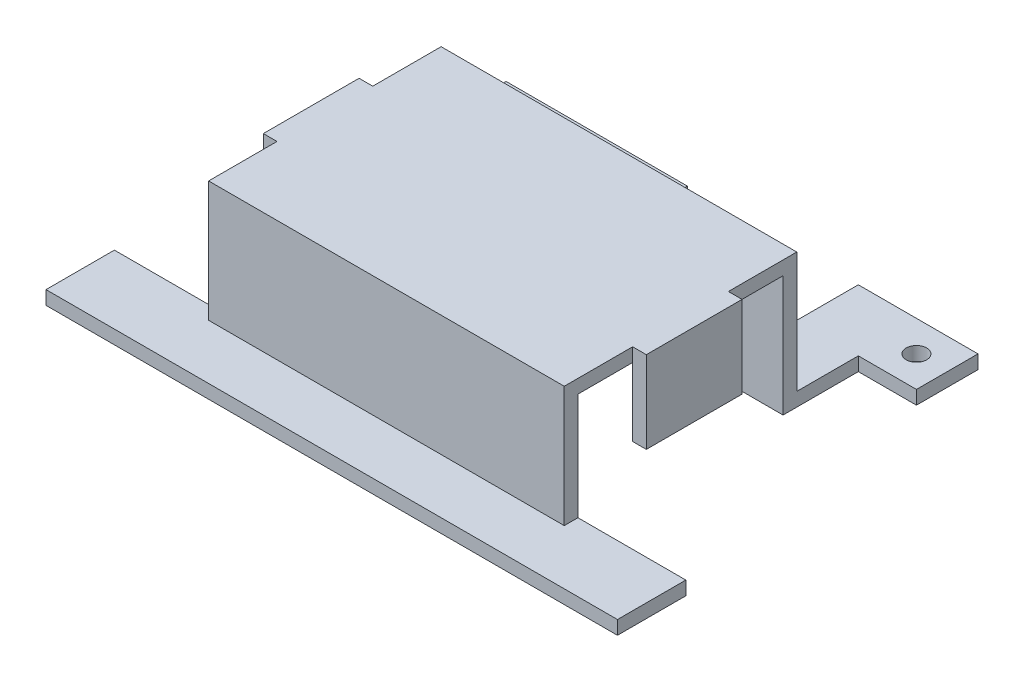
ISO-10303-21;
HEADER;
FILE_DESCRIPTION(('STEP AP214'),'2;1');
FILE_NAME('part.step','',(''),(''),'','','');
FILE_SCHEMA(('AUTOMOTIVE_DESIGN { 1 0 10303 214 1 1 1 1 }'));
ENDSEC;
DATA;
#1=APPLICATION_CONTEXT('core data for automotive mechanical design processes');
#2=APPLICATION_PROTOCOL_DEFINITION('international standard','automotive_design',2000,#1);
#3=PRODUCT_CONTEXT('',#1,'mechanical');
#4=PRODUCT('Part','Part','',(#3));
#5=PRODUCT_RELATED_PRODUCT_CATEGORY('part','',(#4));
#6=PRODUCT_DEFINITION_FORMATION('','',#4);
#7=PRODUCT_DEFINITION_CONTEXT('part definition',#1,'design');
#8=PRODUCT_DEFINITION('design','',#6,#7);
#9=PRODUCT_DEFINITION_SHAPE('','',#8);
#10=(LENGTH_UNIT() NAMED_UNIT(*) SI_UNIT(.MILLI.,.METRE.));
#11=(NAMED_UNIT(*) PLANE_ANGLE_UNIT() SI_UNIT($,.RADIAN.));
#12=(NAMED_UNIT(*) SI_UNIT($,.STERADIAN.) SOLID_ANGLE_UNIT());
#13=UNCERTAINTY_MEASURE_WITH_UNIT(LENGTH_MEASURE(1.E-05),#10,'distance_accuracy_value','');
#14=(GEOMETRIC_REPRESENTATION_CONTEXT(3) GLOBAL_UNCERTAINTY_ASSIGNED_CONTEXT((#13)) GLOBAL_UNIT_ASSIGNED_CONTEXT((#10,
#11,#12)) REPRESENTATION_CONTEXT('',''));
#15=CARTESIAN_POINT('',(0.,0.,0.));
#16=DIRECTION('',(0.,0.,1.));
#17=DIRECTION('',(1.,0.,0.));
#18=AXIS2_PLACEMENT_3D('',#15,#16,#17);
#19=CARTESIAN_POINT('',(0.,17.65,0.));
#20=DIRECTION('',(0.,1.,0.));
#21=DIRECTION('',(0.,0.,1.));
#22=AXIS2_PLACEMENT_3D('',#19,#20,#21);
#23=PLANE('',#22);
#24=DIRECTION('',(0.,0.,-1.));
#25=VECTOR('',#24,1.);
#26=CARTESIAN_POINT('',(52.,17.65,-24.));
#27=LINE('',#26,#25);
#28=CARTESIAN_POINT('',(52.,17.65,-10.));
#29=VERTEX_POINT('',#28);
#30=CARTESIAN_POINT('',(52.,17.65,-24.));
#31=VERTEX_POINT('',#30);
#32=EDGE_CURVE('E279',#29,#31,#27,.T.);
#33=ORIENTED_EDGE('',*,*,#32,.F.);
#34=DIRECTION('',(0.,0.,1.));
#35=VECTOR('',#34,1.);
#36=CARTESIAN_POINT('',(52.,17.65,-2.));
#37=LINE('',#36,#35);
#38=CARTESIAN_POINT('',(52.,17.65,-2.));
#39=VERTEX_POINT('',#38);
#40=EDGE_CURVE('E547',#29,#39,#37,.T.);
#41=ORIENTED_EDGE('',*,*,#40,.T.);
#42=DIRECTION('',(-1.,0.,0.));
#43=VECTOR('',#42,1.);
#44=CARTESIAN_POINT('',(52.,17.65,-2.));
#45=LINE('',#44,#43);
#46=CARTESIAN_POINT('',(0.,17.65,-2.));
#47=VERTEX_POINT('',#46);
#48=EDGE_CURVE('E546',#39,#47,#45,.T.);
#49=ORIENTED_EDGE('',*,*,#48,.T.);
#50=DIRECTION('',(0.,0.,-1.));
#51=VECTOR('',#50,1.);
#52=CARTESIAN_POINT('',(0.,17.65,-2.));
#53=LINE('',#52,#51);
#54=CARTESIAN_POINT('',(0.,17.65,-10.));
#55=VERTEX_POINT('',#54);
#56=EDGE_CURVE('E552',#47,#55,#53,.T.);
#57=ORIENTED_EDGE('',*,*,#56,.T.);
#58=DIRECTION('',(0.,0.,1.));
#59=VECTOR('',#58,1.);
#60=CARTESIAN_POINT('',(0.,17.65,-24.));
#61=LINE('',#60,#59);
#62=CARTESIAN_POINT('',(0.,17.65,-24.));
#63=VERTEX_POINT('',#62);
#64=EDGE_CURVE('E285',#63,#55,#61,.T.);
#65=ORIENTED_EDGE('',*,*,#64,.F.);
#66=CARTESIAN_POINT('',(0.,17.65,-34.));
#67=VERTEX_POINT('',#66);
#68=EDGE_CURVE('E551',#63,#67,#53,.T.);
#69=ORIENTED_EDGE('',*,*,#68,.T.);
#70=DIRECTION('',(-1.,0.,0.));
#71=VECTOR('',#70,1.);
#72=CARTESIAN_POINT('',(0.,17.65,-34.));
#73=LINE('',#72,#71);
#74=CARTESIAN_POINT('',(9.5,17.65,-34.));
#75=VERTEX_POINT('',#74);
#76=EDGE_CURVE('E398',#75,#67,#73,.T.);
#77=ORIENTED_EDGE('',*,*,#76,.F.);
#78=DIRECTION('',(0.,0.,-1.));
#79=VECTOR('',#78,1.);
#80=CARTESIAN_POINT('',(9.5,17.65,-43.));
#81=LINE('',#80,#79);
#82=CARTESIAN_POINT('',(9.5,17.65,-32.));
#83=VERTEX_POINT('',#82);
#84=EDGE_CURVE('E385',#83,#75,#81,.T.);
#85=ORIENTED_EDGE('',*,*,#84,.F.);
#86=DIRECTION('',(1.,0.,0.));
#87=VECTOR('',#86,1.);
#88=CARTESIAN_POINT('',(52.,17.65,-32.));
#89=LINE('',#88,#87);
#90=CARTESIAN_POINT('',(52.,17.65,-32.));
#91=VERTEX_POINT('',#90);
#92=EDGE_CURVE('E556',#83,#91,#89,.T.);
#93=ORIENTED_EDGE('',*,*,#92,.T.);
#94=EDGE_CURVE('E542',#91,#31,#37,.T.);
#95=ORIENTED_EDGE('',*,*,#94,.T.);
#96=EDGE_LOOP('',(#33,#41,#49,#57,#65,#69,#77,#85,#93,#95));
#97=FACE_BOUND('',#96,.T.);
#98=ADVANCED_FACE('F39',(#97),#23,.F.);
#99=CARTESIAN_POINT('',(52.,19.65,0.));
#100=DIRECTION('',(-1.,0.,0.));
#101=DIRECTION('',(0.,0.,1.));
#102=AXIS2_PLACEMENT_3D('',#99,#100,#101);
#103=PLANE('',#102);
#104=DIRECTION('',(0.,1.,0.));
#105=VECTOR('',#104,1.);
#106=CARTESIAN_POINT('',(52.,17.65,-24.));
#107=LINE('',#106,#105);
#108=CARTESIAN_POINT('',(52.,19.65,-24.));
#109=VERTEX_POINT('',#108);
#110=EDGE_CURVE('E316',#31,#109,#107,.T.);
#111=ORIENTED_EDGE('',*,*,#110,.F.);
#112=ORIENTED_EDGE('',*,*,#94,.F.);
#113=DIRECTION('',(0.,-1.,0.));
#114=VECTOR('',#113,1.);
#115=CARTESIAN_POINT('',(52.,17.65,-32.));
#116=LINE('',#115,#114);
#117=CARTESIAN_POINT('',(52.,0.,-32.));
#118=VERTEX_POINT('',#117);
#119=EDGE_CURVE('E565',#91,#118,#116,.T.);
#120=ORIENTED_EDGE('',*,*,#119,.T.);
#121=DIRECTION('',(0.,0.,-1.));
#122=VECTOR('',#121,1.);
#123=CARTESIAN_POINT('',(52.,0.,0.));
#124=LINE('',#123,#122);
#125=CARTESIAN_POINT('',(52.,0.,-43.));
#126=VERTEX_POINT('',#125);
#127=EDGE_CURVE('E569',#118,#126,#124,.T.);
#128=ORIENTED_EDGE('',*,*,#127,.T.);
#129=DIRECTION('',(0.,1.,0.));
#130=VECTOR('',#129,1.);
#131=CARTESIAN_POINT('',(52.,2.,-43.));
#132=LINE('',#131,#130);
#133=CARTESIAN_POINT('',(52.,2.,-43.));
#134=VERTEX_POINT('',#133);
#135=EDGE_CURVE('E361',#126,#134,#132,.T.);
#136=ORIENTED_EDGE('',*,*,#135,.T.);
#137=DIRECTION('',(0.,0.,1.));
#138=VECTOR('',#137,1.);
#139=CARTESIAN_POINT('',(52.,2.,-43.));
#140=LINE('',#139,#138);
#141=CARTESIAN_POINT('',(52.,2.,-34.));
#142=VERTEX_POINT('',#141);
#143=EDGE_CURVE('E365',#134,#142,#140,.T.);
#144=ORIENTED_EDGE('',*,*,#143,.T.);
#145=DIRECTION('',(0.,-1.,0.));
#146=VECTOR('',#145,1.);
#147=CARTESIAN_POINT('',(52.,19.65,-34.));
#148=LINE('',#147,#146);
#149=CARTESIAN_POINT('',(52.,19.65,-34.));
#150=VERTEX_POINT('',#149);
#151=EDGE_CURVE('E603',#150,#142,#148,.T.);
#152=ORIENTED_EDGE('',*,*,#151,.F.);
#153=DIRECTION('',(0.,0.,-1.));
#154=VECTOR('',#153,1.);
#155=CARTESIAN_POINT('',(52.,19.65,0.));
#156=LINE('',#155,#154);
#157=EDGE_CURVE('E585',#109,#150,#156,.T.);
#158=ORIENTED_EDGE('',*,*,#157,.F.);
#159=EDGE_LOOP('',(#111,#112,#120,#128,#136,#144,#152,#158));
#160=FACE_BOUND('',#159,.T.);
#161=ADVANCED_FACE('F669',(#160),#103,.F.);
#162=DIRECTION('',(0.,-1.,0.));
#163=VECTOR('',#162,1.);
#164=CARTESIAN_POINT('',(52.,17.65,-10.));
#165=LINE('',#164,#163);
#166=CARTESIAN_POINT('',(52.,19.65,-10.));
#167=VERTEX_POINT('',#166);
#168=EDGE_CURVE('E320',#167,#29,#165,.T.);
#169=ORIENTED_EDGE('',*,*,#168,.F.);
#170=CARTESIAN_POINT('',(52.,19.65,0.));
#171=VERTEX_POINT('',#170);
#172=EDGE_CURVE('E586',#171,#167,#156,.T.);
#173=ORIENTED_EDGE('',*,*,#172,.F.);
#174=DIRECTION('',(0.,-1.,0.));
#175=VECTOR('',#174,1.);
#176=CARTESIAN_POINT('',(52.,19.65,0.));
#177=LINE('',#176,#175);
#178=CARTESIAN_POINT('',(52.,2.,0.));
#179=VERTEX_POINT('',#178);
#180=EDGE_CURVE('E607',#171,#179,#177,.T.);
#181=ORIENTED_EDGE('',*,*,#180,.T.);
#182=DIRECTION('',(0.,0.,1.));
#183=VECTOR('',#182,1.);
#184=CARTESIAN_POINT('',(52.,2.,8.));
#185=LINE('',#184,#183);
#186=CARTESIAN_POINT('',(52.,2.,-2.));
#187=VERTEX_POINT('',#186);
#188=EDGE_CURVE('E402',#187,#179,#185,.T.);
#189=ORIENTED_EDGE('',*,*,#188,.F.);
#190=DIRECTION('',(0.,-1.,0.));
#191=VECTOR('',#190,1.);
#192=CARTESIAN_POINT('',(52.,17.65,-2.));
#193=LINE('',#192,#191);
#194=EDGE_CURVE('E559',#39,#187,#193,.T.);
#195=ORIENTED_EDGE('',*,*,#194,.F.);
#196=ORIENTED_EDGE('',*,*,#40,.F.);
#197=EDGE_LOOP('',(#169,#173,#181,#189,#195,#196));
#198=FACE_BOUND('',#197,.T.);
#199=ADVANCED_FACE('F692',(#198),#103,.F.);
#200=CARTESIAN_POINT('',(0.,19.65,0.));
#201=DIRECTION('',(1.,0.,0.));
#202=DIRECTION('',(0.,0.,-1.));
#203=AXIS2_PLACEMENT_3D('',#200,#201,#202);
#204=PLANE('',#203);
#205=DIRECTION('',(0.,-1.,0.));
#206=VECTOR('',#205,1.);
#207=CARTESIAN_POINT('',(0.,19.65,-24.));
#208=LINE('',#207,#206);
#209=CARTESIAN_POINT('',(0.,19.65,-24.));
#210=VERTEX_POINT('',#209);
#211=EDGE_CURVE('E337',#210,#63,#208,.T.);
#212=ORIENTED_EDGE('',*,*,#211,.F.);
#213=DIRECTION('',(0.,0.,1.));
#214=VECTOR('',#213,1.);
#215=CARTESIAN_POINT('',(0.,19.65,0.));
#216=LINE('',#215,#214);
#217=CARTESIAN_POINT('',(0.,19.65,-34.));
#218=VERTEX_POINT('',#217);
#219=EDGE_CURVE('E577',#218,#210,#216,.T.);
#220=ORIENTED_EDGE('',*,*,#219,.F.);
#221=DIRECTION('',(0.,-1.,0.));
#222=VECTOR('',#221,1.);
#223=CARTESIAN_POINT('',(0.,19.65,-34.));
#224=LINE('',#223,#222);
#225=EDGE_CURVE('E593',#218,#67,#224,.T.);
#226=ORIENTED_EDGE('',*,*,#225,.T.);
#227=ORIENTED_EDGE('',*,*,#68,.F.);
#228=EDGE_LOOP('',(#212,#220,#226,#227));
#229=FACE_BOUND('',#228,.T.);
#230=ADVANCED_FACE('F41',(#229),#204,.F.);
#231=DIRECTION('',(0.,1.,0.));
#232=VECTOR('',#231,1.);
#233=CARTESIAN_POINT('',(0.,19.65,-10.));
#234=LINE('',#233,#232);
#235=CARTESIAN_POINT('',(0.,19.65,-10.));
#236=VERTEX_POINT('',#235);
#237=EDGE_CURVE('E342',#55,#236,#234,.T.);
#238=ORIENTED_EDGE('',*,*,#237,.F.);
#239=ORIENTED_EDGE('',*,*,#56,.F.);
#240=DIRECTION('',(0.,-1.,0.));
#241=VECTOR('',#240,1.);
#242=CARTESIAN_POINT('',(0.,17.65,-2.));
#243=LINE('',#242,#241);
#244=CARTESIAN_POINT('',(0.,2.,-2.));
#245=VERTEX_POINT('',#244);
#246=EDGE_CURVE('E570',#47,#245,#243,.T.);
#247=ORIENTED_EDGE('',*,*,#246,.T.);
#248=DIRECTION('',(0.,0.,-1.));
#249=VECTOR('',#248,1.);
#250=CARTESIAN_POINT('',(0.,2.,8.));
#251=LINE('',#250,#249);
#252=CARTESIAN_POINT('',(0.,2.,0.));
#253=VERTEX_POINT('',#252);
#254=EDGE_CURVE('E423',#253,#245,#251,.T.);
#255=ORIENTED_EDGE('',*,*,#254,.F.);
#256=DIRECTION('',(0.,-1.,0.));
#257=VECTOR('',#256,1.);
#258=CARTESIAN_POINT('',(0.,19.65,0.));
#259=LINE('',#258,#257);
#260=CARTESIAN_POINT('',(0.,19.65,0.));
#261=VERTEX_POINT('',#260);
#262=EDGE_CURVE('E611',#261,#253,#259,.T.);
#263=ORIENTED_EDGE('',*,*,#262,.F.);
#264=EDGE_CURVE('E582',#236,#261,#216,.T.);
#265=ORIENTED_EDGE('',*,*,#264,.F.);
#266=EDGE_LOOP('',(#238,#239,#247,#255,#263,#265));
#267=FACE_BOUND('',#266,.T.);
#268=ADVANCED_FACE('F706',(#267),#204,.F.);
#269=CARTESIAN_POINT('',(52.,17.65,-32.));
#270=DIRECTION('',(0.,0.,-1.));
#271=DIRECTION('',(-1.,0.,0.));
#272=AXIS2_PLACEMENT_3D('',#269,#270,#271);
#273=PLANE('',#272);
#274=DIRECTION('',(0.,1.,0.));
#275=VECTOR('',#274,1.);
#276=CARTESIAN_POINT('',(9.5,17.65,-32.));
#277=LINE('',#276,#275);
#278=CARTESIAN_POINT('',(9.5,0.,-32.));
#279=VERTEX_POINT('',#278);
#280=EDGE_CURVE('E382',#279,#83,#277,.T.);
#281=ORIENTED_EDGE('',*,*,#280,.F.);
#282=DIRECTION('',(1.,0.,0.));
#283=VECTOR('',#282,1.);
#284=CARTESIAN_POINT('',(52.,0.,-32.));
#285=LINE('',#284,#283);
#286=EDGE_CURVE('E562',#279,#118,#285,.T.);
#287=ORIENTED_EDGE('',*,*,#286,.T.);
#288=ORIENTED_EDGE('',*,*,#119,.F.);
#289=ORIENTED_EDGE('',*,*,#92,.F.);
#290=EDGE_LOOP('',(#281,#287,#288,#289));
#291=FACE_BOUND('',#290,.T.);
#292=ADVANCED_FACE('F743',(#291),#273,.F.);
#293=CARTESIAN_POINT('',(0.,19.65,0.));
#294=DIRECTION('',(0.,0.,-1.));
#295=DIRECTION('',(-1.,0.,0.));
#296=AXIS2_PLACEMENT_3D('',#293,#294,#295);
#297=PLANE('',#296);
#298=DIRECTION('',(-1.,0.,0.));
#299=VECTOR('',#298,1.);
#300=CARTESIAN_POINT('',(0.,2.,0.));
#301=LINE('',#300,#299);
#302=EDGE_CURVE('E445',#179,#253,#301,.T.);
#303=ORIENTED_EDGE('',*,*,#302,.F.);
#304=ORIENTED_EDGE('',*,*,#180,.F.);
#305=DIRECTION('',(1.,0.,0.));
#306=VECTOR('',#305,1.);
#307=CARTESIAN_POINT('',(0.,19.65,0.));
#308=LINE('',#307,#306);
#309=EDGE_CURVE('E581',#261,#171,#308,.T.);
#310=ORIENTED_EDGE('',*,*,#309,.F.);
#311=ORIENTED_EDGE('',*,*,#262,.T.);
#312=EDGE_LOOP('',(#303,#304,#310,#311));
#313=FACE_BOUND('',#312,.T.);
#314=ADVANCED_FACE('F700',(#313),#297,.F.);
#315=CARTESIAN_POINT('',(0.,19.65,-34.));
#316=DIRECTION('',(0.,0.,1.));
#317=DIRECTION('',(1.,0.,0.));
#318=AXIS2_PLACEMENT_3D('',#315,#316,#317);
#319=PLANE('',#318);
#320=DIRECTION('',(0.,-1.,0.));
#321=VECTOR('',#320,1.);
#322=CARTESIAN_POINT('',(9.5,19.65,-34.));
#323=LINE('',#322,#321);
#324=CARTESIAN_POINT('',(9.5,2.,-34.));
#325=VERTEX_POINT('',#324);
#326=EDGE_CURVE('E395',#75,#325,#323,.T.);
#327=ORIENTED_EDGE('',*,*,#326,.F.);
#328=ORIENTED_EDGE('',*,*,#76,.T.);
#329=ORIENTED_EDGE('',*,*,#225,.F.);
#330=DIRECTION('',(-1.,0.,0.));
#331=VECTOR('',#330,1.);
#332=CARTESIAN_POINT('',(0.,19.65,-34.));
#333=LINE('',#332,#331);
#334=EDGE_CURVE('E590',#150,#218,#333,.T.);
#335=ORIENTED_EDGE('',*,*,#334,.F.);
#336=ORIENTED_EDGE('',*,*,#151,.T.);
#337=DIRECTION('',(1.,0.,0.));
#338=VECTOR('',#337,1.);
#339=CARTESIAN_POINT('',(52.,2.,-34.));
#340=LINE('',#339,#338);
#341=CARTESIAN_POINT('',(43.,2.,-34.));
#342=VERTEX_POINT('',#341);
#343=EDGE_CURVE('E521',#342,#142,#340,.T.);
#344=ORIENTED_EDGE('',*,*,#343,.F.);
#345=DIRECTION('',(0.,1.,0.));
#346=VECTOR('',#345,1.);
#347=CARTESIAN_POINT('',(43.,0.,-34.));
#348=LINE('',#347,#346);
#349=CARTESIAN_POINT('',(43.,0.,-34.));
#350=VERTEX_POINT('',#349);
#351=EDGE_CURVE('E516',#350,#342,#348,.T.);
#352=ORIENTED_EDGE('',*,*,#351,.F.);
#353=DIRECTION('',(-1.,0.,0.));
#354=VECTOR('',#353,1.);
#355=CARTESIAN_POINT('',(0.,0.,-34.));
#356=LINE('',#355,#354);
#357=CARTESIAN_POINT('',(18.,0.,-34.));
#358=VERTEX_POINT('',#357);
#359=EDGE_CURVE('E596',#350,#358,#356,.T.);
#360=ORIENTED_EDGE('',*,*,#359,.T.);
#361=DIRECTION('',(0.,-1.,0.));
#362=VECTOR('',#361,1.);
#363=CARTESIAN_POINT('',(18.,0.,-34.));
#364=LINE('',#363,#362);
#365=CARTESIAN_POINT('',(18.,2.,-34.));
#366=VERTEX_POINT('',#365);
#367=EDGE_CURVE('E498',#366,#358,#364,.T.);
#368=ORIENTED_EDGE('',*,*,#367,.F.);
#369=DIRECTION('',(1.,0.,0.));
#370=VECTOR('',#369,1.);
#371=CARTESIAN_POINT('',(0.,2.,-34.));
#372=LINE('',#371,#370);
#373=EDGE_CURVE('E493',#325,#366,#372,.T.);
#374=ORIENTED_EDGE('',*,*,#373,.F.);
#375=EDGE_LOOP('',(#327,#328,#329,#335,#336,#344,#352,#360,#368,#374));
#376=FACE_BOUND('',#375,.T.);
#377=ADVANCED_FACE('F643',(#376),#319,.F.);
#378=CARTESIAN_POINT('',(0.,0.,0.));
#379=DIRECTION('',(0.,-1.,0.));
#380=DIRECTION('',(0.,0.,-1.));
#381=AXIS2_PLACEMENT_3D('',#378,#379,#380);
#382=PLANE('',#381);
#383=DIRECTION('',(1.,0.,0.));
#384=VECTOR('',#383,1.);
#385=CARTESIAN_POINT('',(52.,0.,-43.));
#386=LINE('',#385,#384);
#387=CARTESIAN_POINT('',(60.5,0.,-43.));
#388=VERTEX_POINT('',#387);
#389=EDGE_CURVE('E55',#126,#388,#386,.T.);
#390=ORIENTED_EDGE('',*,*,#389,.F.);
#391=ORIENTED_EDGE('',*,*,#127,.F.);
#392=ORIENTED_EDGE('',*,*,#286,.F.);
#393=DIRECTION('',(0.,0.,1.));
#394=VECTOR('',#393,1.);
#395=CARTESIAN_POINT('',(9.5,0.,-43.));
#396=LINE('',#395,#394);
#397=CARTESIAN_POINT('',(9.5,0.,-43.));
#398=VERTEX_POINT('',#397);
#399=EDGE_CURVE('E379',#398,#279,#396,.T.);
#400=ORIENTED_EDGE('',*,*,#399,.F.);
#401=DIRECTION('',(-1.,0.,0.));
#402=VECTOR('',#401,1.);
#403=CARTESIAN_POINT('',(9.5,0.,-43.));
#404=LINE('',#403,#402);
#405=CARTESIAN_POINT('',(-8.5,0.,-43.));
#406=VERTEX_POINT('',#405);
#407=EDGE_CURVE('E389',#398,#406,#404,.T.);
#408=ORIENTED_EDGE('',*,*,#407,.T.);
#409=DIRECTION('',(0.,0.,1.));
#410=VECTOR('',#409,1.);
#411=CARTESIAN_POINT('',(-8.5,0.,-34.));
#412=LINE('',#411,#410);
#413=CARTESIAN_POINT('',(-8.5,0.,-52.));
#414=VERTEX_POINT('',#413);
#415=EDGE_CURVE('E478',#414,#406,#412,.T.);
#416=ORIENTED_EDGE('',*,*,#415,.F.);
#417=DIRECTION('',(-1.,0.,0.));
#418=VECTOR('',#417,1.);
#419=CARTESIAN_POINT('',(0.,0.,-52.));
#420=LINE('',#419,#418);
#421=CARTESIAN_POINT('',(18.,0.,-52.));
#422=VERTEX_POINT('',#421);
#423=EDGE_CURVE('E501',#422,#414,#420,.T.);
#424=ORIENTED_EDGE('',*,*,#423,.F.);
#425=DIRECTION('',(0.,0.,1.));
#426=VECTOR('',#425,1.);
#427=CARTESIAN_POINT('',(18.,0.,-52.));
#428=LINE('',#427,#426);
#429=EDGE_CURVE('E504',#422,#358,#428,.T.);
#430=ORIENTED_EDGE('',*,*,#429,.T.);
#431=ORIENTED_EDGE('',*,*,#359,.F.);
#432=DIRECTION('',(0.,0.,1.));
#433=VECTOR('',#432,1.);
#434=CARTESIAN_POINT('',(43.,0.,-52.));
#435=LINE('',#434,#433);
#436=CARTESIAN_POINT('',(43.,0.,-52.));
#437=VERTEX_POINT('',#436);
#438=EDGE_CURVE('E537',#437,#350,#435,.T.);
#439=ORIENTED_EDGE('',*,*,#438,.F.);
#440=DIRECTION('',(-1.,0.,0.));
#441=VECTOR('',#440,1.);
#442=CARTESIAN_POINT('',(52.,0.,-52.));
#443=LINE('',#442,#441);
#444=CARTESIAN_POINT('',(60.5,0.,-52.));
#445=VERTEX_POINT('',#444);
#446=EDGE_CURVE('E517',#445,#437,#443,.T.);
#447=ORIENTED_EDGE('',*,*,#446,.F.);
#448=DIRECTION('',(0.,0.,-1.));
#449=VECTOR('',#448,1.);
#450=CARTESIAN_POINT('',(60.5,0.,-34.));
#451=LINE('',#450,#449);
#452=EDGE_CURVE('E482',#388,#445,#451,.T.);
#453=ORIENTED_EDGE('',*,*,#452,.F.);
#454=EDGE_LOOP('',(#390,#391,#392,#400,#408,#416,#424,#430,#431,#439,#447,#453));
#455=FACE_BOUND('',#454,.T.);
#456=CARTESIAN_POINT('',(56.,0.,-47.5));
#457=DIRECTION('',(0.,1.,0.));
#458=DIRECTION('',(0.,0.,1.));
#459=AXIS2_PLACEMENT_3D('',#456,#457,#458);
#460=CIRCLE('',#459,1.5);
#461=CARTESIAN_POINT('',(56.,0.,-46.));
#462=VERTEX_POINT('',#461);
#463=EDGE_CURVE('E456',#462,#462,#460,.T.);
#464=ORIENTED_EDGE('',*,*,#463,.T.);
#465=EDGE_LOOP('',(#464));
#466=FACE_BOUND('',#465,.T.);
#467=CARTESIAN_POINT('',(-4.,0.,-47.5));
#468=DIRECTION('',(0.,1.,0.));
#469=DIRECTION('',(0.,0.,1.));
#470=AXIS2_PLACEMENT_3D('',#467,#468,#469);
#471=CIRCLE('',#470,1.5);
#472=CARTESIAN_POINT('',(-4.,0.,-46.));
#473=VERTEX_POINT('',#472);
#474=EDGE_CURVE('E465',#473,#473,#471,.T.);
#475=ORIENTED_EDGE('',*,*,#474,.T.);
#476=EDGE_LOOP('',(#475));
#477=FACE_BOUND('',#476,.T.);
#478=ADVANCED_FACE('F631',(#455,#466,#477),#382,.T.);
#479=CARTESIAN_POINT('',(0.,19.65,0.));
#480=DIRECTION('',(0.,-1.,0.));
#481=DIRECTION('',(0.,0.,-1.));
#482=AXIS2_PLACEMENT_3D('',#479,#480,#481);
#483=PLANE('',#482);
#484=ORIENTED_EDGE('',*,*,#219,.T.);
#485=DIRECTION('',(1.,0.,0.));
#486=VECTOR('',#485,1.);
#487=CARTESIAN_POINT('',(-2.,19.65,-24.));
#488=LINE('',#487,#486);
#489=CARTESIAN_POINT('',(-2.,19.65,-24.));
#490=VERTEX_POINT('',#489);
#491=EDGE_CURVE('E348',#490,#210,#488,.T.);
#492=ORIENTED_EDGE('',*,*,#491,.F.);
#493=DIRECTION('',(0.,0.,-1.));
#494=VECTOR('',#493,1.);
#495=CARTESIAN_POINT('',(-2.,19.65,-24.));
#496=LINE('',#495,#494);
#497=CARTESIAN_POINT('',(-2.,19.65,-10.));
#498=VERTEX_POINT('',#497);
#499=EDGE_CURVE('E345',#498,#490,#496,.T.);
#500=ORIENTED_EDGE('',*,*,#499,.F.);
#501=DIRECTION('',(1.,0.,0.));
#502=VECTOR('',#501,1.);
#503=CARTESIAN_POINT('',(-2.,19.65,-10.));
#504=LINE('',#503,#502);
#505=EDGE_CURVE('E356',#498,#236,#504,.T.);
#506=ORIENTED_EDGE('',*,*,#505,.T.);
#507=ORIENTED_EDGE('',*,*,#264,.T.);
#508=ORIENTED_EDGE('',*,*,#309,.T.);
#509=ORIENTED_EDGE('',*,*,#172,.T.);
#510=DIRECTION('',(-1.,0.,0.));
#511=VECTOR('',#510,1.);
#512=CARTESIAN_POINT('',(54.,19.65,-10.));
#513=LINE('',#512,#511);
#514=CARTESIAN_POINT('',(54.,19.65,-10.));
#515=VERTEX_POINT('',#514);
#516=EDGE_CURVE('E326',#515,#167,#513,.T.);
#517=ORIENTED_EDGE('',*,*,#516,.F.);
#518=DIRECTION('',(0.,0.,1.));
#519=VECTOR('',#518,1.);
#520=CARTESIAN_POINT('',(54.,19.65,-24.));
#521=LINE('',#520,#519);
#522=CARTESIAN_POINT('',(54.,19.65,-24.));
#523=VERTEX_POINT('',#522);
#524=EDGE_CURVE('E319',#523,#515,#521,.T.);
#525=ORIENTED_EDGE('',*,*,#524,.F.);
#526=DIRECTION('',(-1.,0.,0.));
#527=VECTOR('',#526,1.);
#528=CARTESIAN_POINT('',(54.,19.65,-24.));
#529=LINE('',#528,#527);
#530=EDGE_CURVE('E334',#523,#109,#529,.T.);
#531=ORIENTED_EDGE('',*,*,#530,.T.);
#532=ORIENTED_EDGE('',*,*,#157,.T.);
#533=ORIENTED_EDGE('',*,*,#334,.T.);
#534=EDGE_LOOP('',(#484,#492,#500,#506,#507,#508,#509,#517,#525,#531,#532,#533));
#535=FACE_BOUND('',#534,.T.);
#536=ADVANCED_FACE('F675',(#535),#483,.F.);
#537=DIRECTION('',(-1.,0.,0.));
#538=VECTOR('',#537,1.);
#539=CARTESIAN_POINT('',(52.,0.,-2.));
#540=LINE('',#539,#538);
#541=CARTESIAN_POINT('',(67.78,0.,-2.));
#542=VERTEX_POINT('',#541);
#543=CARTESIAN_POINT('',(-15.78,0.,-2.));
#544=VERTEX_POINT('',#543);
#545=EDGE_CURVE('E541',#542,#544,#540,.T.);
#546=ORIENTED_EDGE('',*,*,#545,.F.);
#547=DIRECTION('',(0.,0.,-1.));
#548=VECTOR('',#547,1.);
#549=CARTESIAN_POINT('',(67.78,0.,8.));
#550=LINE('',#549,#548);
#551=CARTESIAN_POINT('',(67.78,0.,8.));
#552=VERTEX_POINT('',#551);
#553=EDGE_CURVE('E407',#552,#542,#550,.T.);
#554=ORIENTED_EDGE('',*,*,#553,.F.);
#555=DIRECTION('',(1.,0.,0.));
#556=VECTOR('',#555,1.);
#557=CARTESIAN_POINT('',(0.,0.,8.));
#558=LINE('',#557,#556);
#559=CARTESIAN_POINT('',(-15.78,0.,8.));
#560=VERTEX_POINT('',#559);
#561=EDGE_CURVE('E446',#560,#552,#558,.T.);
#562=ORIENTED_EDGE('',*,*,#561,.F.);
#563=DIRECTION('',(0.,0.,1.));
#564=VECTOR('',#563,1.);
#565=CARTESIAN_POINT('',(-15.78,0.,8.));
#566=LINE('',#565,#564);
#567=EDGE_CURVE('E435',#544,#560,#566,.T.);
#568=ORIENTED_EDGE('',*,*,#567,.F.);
#569=EDGE_LOOP('',(#546,#554,#562,#568));
#570=FACE_BOUND('',#569,.T.);
#571=ADVANCED_FACE('F716',(#570),#382,.T.);
#572=CARTESIAN_POINT('',(52.,17.65,-2.));
#573=DIRECTION('',(0.,0.,1.));
#574=DIRECTION('',(1.,0.,0.));
#575=AXIS2_PLACEMENT_3D('',#572,#573,#574);
#576=PLANE('',#575);
#577=ORIENTED_EDGE('',*,*,#545,.T.);
#578=DIRECTION('',(0.,-1.,0.));
#579=VECTOR('',#578,1.);
#580=CARTESIAN_POINT('',(-15.78,2.,-2.));
#581=LINE('',#580,#579);
#582=CARTESIAN_POINT('',(-15.78,2.,-2.));
#583=VERTEX_POINT('',#582);
#584=EDGE_CURVE('E431',#583,#544,#581,.T.);
#585=ORIENTED_EDGE('',*,*,#584,.F.);
#586=DIRECTION('',(1.,0.,0.));
#587=VECTOR('',#586,1.);
#588=CARTESIAN_POINT('',(-15.78,2.,-2.));
#589=LINE('',#588,#587);
#590=EDGE_CURVE('E439',#583,#245,#589,.T.);
#591=ORIENTED_EDGE('',*,*,#590,.T.);
#592=ORIENTED_EDGE('',*,*,#246,.F.);
#593=ORIENTED_EDGE('',*,*,#48,.F.);
#594=ORIENTED_EDGE('',*,*,#194,.T.);
#595=DIRECTION('',(-1.,0.,0.));
#596=VECTOR('',#595,1.);
#597=CARTESIAN_POINT('',(67.78,2.,-2.));
#598=LINE('',#597,#596);
#599=CARTESIAN_POINT('',(67.78,2.,-2.));
#600=VERTEX_POINT('',#599);
#601=EDGE_CURVE('E418',#600,#187,#598,.T.);
#602=ORIENTED_EDGE('',*,*,#601,.F.);
#603=DIRECTION('',(0.,1.,0.));
#604=VECTOR('',#603,1.);
#605=CARTESIAN_POINT('',(67.78,2.,-2.));
#606=LINE('',#605,#604);
#607=EDGE_CURVE('E411',#542,#600,#606,.T.);
#608=ORIENTED_EDGE('',*,*,#607,.F.);
#609=EDGE_LOOP('',(#577,#585,#591,#592,#593,#594,#602,#608));
#610=FACE_BOUND('',#609,.T.);
#611=ADVANCED_FACE('F689',(#610),#576,.F.);
#612=CARTESIAN_POINT('',(43.,0.,-52.));
#613=DIRECTION('',(1.,0.,0.));
#614=DIRECTION('',(0.,0.,-1.));
#615=AXIS2_PLACEMENT_3D('',#612,#613,#614);
#616=PLANE('',#615);
#617=ORIENTED_EDGE('',*,*,#351,.T.);
#618=DIRECTION('',(0.,0.,1.));
#619=VECTOR('',#618,1.);
#620=CARTESIAN_POINT('',(43.,2.,-52.));
#621=LINE('',#620,#619);
#622=CARTESIAN_POINT('',(43.,2.,-52.));
#623=VERTEX_POINT('',#622);
#624=EDGE_CURVE('E527',#623,#342,#621,.T.);
#625=ORIENTED_EDGE('',*,*,#624,.F.);
#626=DIRECTION('',(0.,1.,0.));
#627=VECTOR('',#626,1.);
#628=CARTESIAN_POINT('',(43.,0.,-52.));
#629=LINE('',#628,#627);
#630=EDGE_CURVE('E520',#437,#623,#629,.T.);
#631=ORIENTED_EDGE('',*,*,#630,.F.);
#632=ORIENTED_EDGE('',*,*,#438,.T.);
#633=EDGE_LOOP('',(#617,#625,#631,#632));
#634=FACE_BOUND('',#633,.T.);
#635=ADVANCED_FACE('F652',(#634),#616,.F.);
#636=CARTESIAN_POINT('',(52.,2.,-52.));
#637=DIRECTION('',(0.,-1.,0.));
#638=DIRECTION('',(0.,0.,-1.));
#639=AXIS2_PLACEMENT_3D('',#636,#637,#638);
#640=PLANE('',#639);
#641=CARTESIAN_POINT('',(56.,2.,-47.5));
#642=DIRECTION('',(0.,1.,0.));
#643=DIRECTION('',(0.,0.,1.));
#644=AXIS2_PLACEMENT_3D('',#641,#642,#643);
#645=CIRCLE('',#644,1.5);
#646=CARTESIAN_POINT('',(56.,2.,-46.));
#647=VERTEX_POINT('',#646);
#648=EDGE_CURVE('E461',#647,#647,#645,.T.);
#649=ORIENTED_EDGE('',*,*,#648,.F.);
#650=EDGE_LOOP('',(#649));
#651=FACE_BOUND('',#650,.T.);
#652=ORIENTED_EDGE('',*,*,#143,.F.);
#653=DIRECTION('',(1.,0.,0.));
#654=VECTOR('',#653,1.);
#655=CARTESIAN_POINT('',(52.,2.,-43.));
#656=LINE('',#655,#654);
#657=CARTESIAN_POINT('',(60.5,2.,-43.));
#658=VERTEX_POINT('',#657);
#659=EDGE_CURVE('E368',#134,#658,#656,.T.);
#660=ORIENTED_EDGE('',*,*,#659,.T.);
#661=DIRECTION('',(0.,0.,1.));
#662=VECTOR('',#661,1.);
#663=CARTESIAN_POINT('',(60.5,2.,-34.));
#664=LINE('',#663,#662);
#665=CARTESIAN_POINT('',(60.5,2.,-52.));
#666=VERTEX_POINT('',#665);
#667=EDGE_CURVE('E489',#666,#658,#664,.T.);
#668=ORIENTED_EDGE('',*,*,#667,.F.);
#669=DIRECTION('',(1.,0.,0.));
#670=VECTOR('',#669,1.);
#671=CARTESIAN_POINT('',(52.,2.,-52.));
#672=LINE('',#671,#670);
#673=EDGE_CURVE('E524',#623,#666,#672,.T.);
#674=ORIENTED_EDGE('',*,*,#673,.F.);
#675=ORIENTED_EDGE('',*,*,#624,.T.);
#676=ORIENTED_EDGE('',*,*,#343,.T.);
#677=EDGE_LOOP('',(#652,#660,#668,#674,#675,#676));
#678=FACE_BOUND('',#677,.T.);
#679=ADVANCED_FACE('F666',(#651,#678),#640,.F.);
#680=CARTESIAN_POINT('',(0.,0.,-52.));
#681=DIRECTION('',(0.,0.,1.));
#682=DIRECTION('',(1.,0.,0.));
#683=AXIS2_PLACEMENT_3D('',#680,#681,#682);
#684=PLANE('',#683);
#685=ORIENTED_EDGE('',*,*,#673,.T.);
#686=DIRECTION('',(0.,1.,0.));
#687=VECTOR('',#686,1.);
#688=CARTESIAN_POINT('',(60.5,2.,-52.));
#689=LINE('',#688,#687);
#690=EDGE_CURVE('E485',#445,#666,#689,.T.);
#691=ORIENTED_EDGE('',*,*,#690,.F.);
#692=ORIENTED_EDGE('',*,*,#446,.T.);
#693=ORIENTED_EDGE('',*,*,#630,.T.);
#694=EDGE_LOOP('',(#685,#691,#692,#693));
#695=FACE_BOUND('',#694,.T.);
#696=ADVANCED_FACE('F656',(#695),#684,.F.);
#697=CARTESIAN_POINT('',(0.,2.,-52.));
#698=DIRECTION('',(0.,-1.,0.));
#699=DIRECTION('',(1.,0.,0.));
#700=AXIS2_PLACEMENT_3D('',#697,#698,#699);
#701=PLANE('',#700);
#702=CARTESIAN_POINT('',(-4.,2.,-47.5));
#703=DIRECTION('',(0.,1.,0.));
#704=DIRECTION('',(0.,0.,1.));
#705=AXIS2_PLACEMENT_3D('',#702,#703,#704);
#706=CIRCLE('',#705,1.5);
#707=CARTESIAN_POINT('',(-4.,2.,-46.));
#708=VERTEX_POINT('',#707);
#709=EDGE_CURVE('E452',#708,#708,#706,.T.);
#710=ORIENTED_EDGE('',*,*,#709,.F.);
#711=EDGE_LOOP('',(#710));
#712=FACE_BOUND('',#711,.T.);
#713=DIRECTION('',(0.,0.,-1.));
#714=VECTOR('',#713,1.);
#715=CARTESIAN_POINT('',(-8.5,2.,-34.));
#716=LINE('',#715,#714);
#717=CARTESIAN_POINT('',(-8.5,2.,-43.));
#718=VERTEX_POINT('',#717);
#719=CARTESIAN_POINT('',(-8.5,2.,-52.));
#720=VERTEX_POINT('',#719);
#721=EDGE_CURVE('E460',#718,#720,#716,.T.);
#722=ORIENTED_EDGE('',*,*,#721,.F.);
#723=DIRECTION('',(1.,0.,0.));
#724=VECTOR('',#723,1.);
#725=CARTESIAN_POINT('',(0.,2.,-43.));
#726=LINE('',#725,#724);
#727=CARTESIAN_POINT('',(9.5,2.,-43.));
#728=VERTEX_POINT('',#727);
#729=EDGE_CURVE('E63',#718,#728,#726,.T.);
#730=ORIENTED_EDGE('',*,*,#729,.T.);
#731=DIRECTION('',(0.,0.,-1.));
#732=VECTOR('',#731,1.);
#733=CARTESIAN_POINT('',(9.5,2.,-52.));
#734=LINE('',#733,#732);
#735=EDGE_CURVE('E11',#325,#728,#734,.T.);
#736=ORIENTED_EDGE('',*,*,#735,.F.);
#737=ORIENTED_EDGE('',*,*,#373,.T.);
#738=DIRECTION('',(0.,0.,1.));
#739=VECTOR('',#738,1.);
#740=CARTESIAN_POINT('',(18.,2.,-52.));
#741=LINE('',#740,#739);
#742=CARTESIAN_POINT('',(18.,2.,-52.));
#743=VERTEX_POINT('',#742);
#744=EDGE_CURVE('E512',#743,#366,#741,.T.);
#745=ORIENTED_EDGE('',*,*,#744,.F.);
#746=DIRECTION('',(1.,0.,0.));
#747=VECTOR('',#746,1.);
#748=CARTESIAN_POINT('',(0.,2.,-52.));
#749=LINE('',#748,#747);
#750=EDGE_CURVE('E494',#720,#743,#749,.T.);
#751=ORIENTED_EDGE('',*,*,#750,.F.);
#752=EDGE_LOOP('',(#722,#730,#736,#737,#745,#751));
#753=FACE_BOUND('',#752,.T.);
#754=ADVANCED_FACE('F622',(#712,#753),#701,.F.);
#755=CARTESIAN_POINT('',(18.,0.,-52.));
#756=DIRECTION('',(-1.,0.,0.));
#757=DIRECTION('',(0.,0.,1.));
#758=AXIS2_PLACEMENT_3D('',#755,#756,#757);
#759=PLANE('',#758);
#760=ORIENTED_EDGE('',*,*,#367,.T.);
#761=ORIENTED_EDGE('',*,*,#429,.F.);
#762=DIRECTION('',(0.,-1.,0.));
#763=VECTOR('',#762,1.);
#764=CARTESIAN_POINT('',(18.,0.,-52.));
#765=LINE('',#764,#763);
#766=EDGE_CURVE('E497',#743,#422,#765,.T.);
#767=ORIENTED_EDGE('',*,*,#766,.F.);
#768=ORIENTED_EDGE('',*,*,#744,.T.);
#769=EDGE_LOOP('',(#760,#761,#767,#768));
#770=FACE_BOUND('',#769,.T.);
#771=ADVANCED_FACE('F647',(#770),#759,.F.);
#772=CARTESIAN_POINT('',(0.,0.,-52.));
#773=DIRECTION('',(0.,0.,-1.));
#774=DIRECTION('',(-1.,0.,0.));
#775=AXIS2_PLACEMENT_3D('',#772,#773,#774);
#776=PLANE('',#775);
#777=ORIENTED_EDGE('',*,*,#423,.T.);
#778=DIRECTION('',(0.,-1.,0.));
#779=VECTOR('',#778,1.);
#780=CARTESIAN_POINT('',(-8.5,2.,-52.));
#781=LINE('',#780,#779);
#782=EDGE_CURVE('E474',#720,#414,#781,.T.);
#783=ORIENTED_EDGE('',*,*,#782,.F.);
#784=ORIENTED_EDGE('',*,*,#750,.T.);
#785=ORIENTED_EDGE('',*,*,#766,.T.);
#786=EDGE_LOOP('',(#777,#783,#784,#785));
#787=FACE_BOUND('',#786,.T.);
#788=ADVANCED_FACE('F628',(#787),#776,.T.);
#789=CARTESIAN_POINT('',(60.5,0.,0.));
#790=DIRECTION('',(1.,0.,0.));
#791=DIRECTION('',(0.,0.,-1.));
#792=AXIS2_PLACEMENT_3D('',#789,#790,#791);
#793=PLANE('',#792);
#794=DIRECTION('',(0.,1.,0.));
#795=VECTOR('',#794,1.);
#796=CARTESIAN_POINT('',(60.5,2.,-43.));
#797=LINE('',#796,#795);
#798=EDGE_CURVE('E360',#388,#658,#797,.T.);
#799=ORIENTED_EDGE('',*,*,#798,.F.);
#800=ORIENTED_EDGE('',*,*,#452,.T.);
#801=ORIENTED_EDGE('',*,*,#690,.T.);
#802=ORIENTED_EDGE('',*,*,#667,.T.);
#803=EDGE_LOOP('',(#799,#800,#801,#802));
#804=FACE_BOUND('',#803,.T.);
#805=ADVANCED_FACE('F661',(#804),#793,.T.);
#806=CARTESIAN_POINT('',(-8.5,0.,0.));
#807=DIRECTION('',(1.,0.,0.));
#808=DIRECTION('',(0.,0.,-1.));
#809=AXIS2_PLACEMENT_3D('',#806,#807,#808);
#810=PLANE('',#809);
#811=ORIENTED_EDGE('',*,*,#415,.T.);
#812=DIRECTION('',(0.,1.,0.));
#813=VECTOR('',#812,1.);
#814=CARTESIAN_POINT('',(-8.5,0.,-43.));
#815=LINE('',#814,#813);
#816=EDGE_CURVE('E48',#406,#718,#815,.T.);
#817=ORIENTED_EDGE('',*,*,#816,.T.);
#818=ORIENTED_EDGE('',*,*,#721,.T.);
#819=ORIENTED_EDGE('',*,*,#782,.T.);
#820=EDGE_LOOP('',(#811,#817,#818,#819));
#821=FACE_BOUND('',#820,.T.);
#822=ADVANCED_FACE('F617',(#821),#810,.F.);
#823=CARTESIAN_POINT('',(-4.,0.,-47.5));
#824=DIRECTION('',(0.,1.,0.));
#825=DIRECTION('',(0.,0.,1.));
#826=AXIS2_PLACEMENT_3D('',#823,#824,#825);
#827=CYLINDRICAL_SURFACE('',#826,1.5);
#828=ORIENTED_EDGE('',*,*,#474,.F.);
#829=EDGE_LOOP('',(#828));
#830=FACE_BOUND('',#829,.T.);
#831=ORIENTED_EDGE('',*,*,#709,.T.);
#832=EDGE_LOOP('',(#831));
#833=FACE_BOUND('',#832,.T.);
#834=ADVANCED_FACE('F843',(#830,#833),#827,.F.);
#835=CARTESIAN_POINT('',(56.,0.,-47.5));
#836=DIRECTION('',(0.,1.,0.));
#837=DIRECTION('',(0.,0.,1.));
#838=AXIS2_PLACEMENT_3D('',#835,#836,#837);
#839=CYLINDRICAL_SURFACE('',#838,1.5);
#840=ORIENTED_EDGE('',*,*,#463,.F.);
#841=EDGE_LOOP('',(#840));
#842=FACE_BOUND('',#841,.T.);
#843=ORIENTED_EDGE('',*,*,#648,.T.);
#844=EDGE_LOOP('',(#843));
#845=FACE_BOUND('',#844,.T.);
#846=ADVANCED_FACE('F852',(#842,#845),#839,.F.);
#847=CARTESIAN_POINT('',(0.,2.,8.));
#848=DIRECTION('',(0.,-1.,0.));
#849=DIRECTION('',(0.,0.,-1.));
#850=AXIS2_PLACEMENT_3D('',#847,#848,#849);
#851=PLANE('',#850);
#852=ORIENTED_EDGE('',*,*,#302,.T.);
#853=ORIENTED_EDGE('',*,*,#254,.T.);
#854=ORIENTED_EDGE('',*,*,#590,.F.);
#855=DIRECTION('',(0.,0.,-1.));
#856=VECTOR('',#855,1.);
#857=CARTESIAN_POINT('',(-15.78,2.,8.));
#858=LINE('',#857,#856);
#859=CARTESIAN_POINT('',(-15.78,2.,8.));
#860=VERTEX_POINT('',#859);
#861=EDGE_CURVE('E428',#860,#583,#858,.T.);
#862=ORIENTED_EDGE('',*,*,#861,.F.);
#863=DIRECTION('',(-1.,0.,0.));
#864=VECTOR('',#863,1.);
#865=CARTESIAN_POINT('',(0.,2.,8.));
#866=LINE('',#865,#864);
#867=CARTESIAN_POINT('',(67.78,2.,8.));
#868=VERTEX_POINT('',#867);
#869=EDGE_CURVE('E449',#868,#860,#866,.T.);
#870=ORIENTED_EDGE('',*,*,#869,.F.);
#871=DIRECTION('',(0.,0.,1.));
#872=VECTOR('',#871,1.);
#873=CARTESIAN_POINT('',(67.78,2.,8.));
#874=LINE('',#873,#872);
#875=EDGE_CURVE('E414',#600,#868,#874,.T.);
#876=ORIENTED_EDGE('',*,*,#875,.F.);
#877=ORIENTED_EDGE('',*,*,#601,.T.);
#878=ORIENTED_EDGE('',*,*,#188,.T.);
#879=EDGE_LOOP('',(#852,#853,#854,#862,#870,#876,#877,#878));
#880=FACE_BOUND('',#879,.T.);
#881=ADVANCED_FACE('F697',(#880),#851,.F.);
#882=CARTESIAN_POINT('',(0.,0.,8.));
#883=DIRECTION('',(0.,0.,1.));
#884=DIRECTION('',(1.,0.,0.));
#885=AXIS2_PLACEMENT_3D('',#882,#883,#884);
#886=PLANE('',#885);
#887=ORIENTED_EDGE('',*,*,#869,.T.);
#888=DIRECTION('',(0.,1.,0.));
#889=VECTOR('',#888,1.);
#890=CARTESIAN_POINT('',(-15.78,2.,8.));
#891=LINE('',#890,#889);
#892=EDGE_CURVE('E424',#560,#860,#891,.T.);
#893=ORIENTED_EDGE('',*,*,#892,.F.);
#894=ORIENTED_EDGE('',*,*,#561,.T.);
#895=DIRECTION('',(0.,-1.,0.));
#896=VECTOR('',#895,1.);
#897=CARTESIAN_POINT('',(67.78,2.,8.));
#898=LINE('',#897,#896);
#899=EDGE_CURVE('E403',#868,#552,#898,.T.);
#900=ORIENTED_EDGE('',*,*,#899,.F.);
#901=EDGE_LOOP('',(#887,#893,#894,#900));
#902=FACE_BOUND('',#901,.T.);
#903=ADVANCED_FACE('F720',(#902),#886,.T.);
#904=CARTESIAN_POINT('',(-15.78,0.,0.));
#905=DIRECTION('',(1.,0.,0.));
#906=DIRECTION('',(0.,0.,-1.));
#907=AXIS2_PLACEMENT_3D('',#904,#905,#906);
#908=PLANE('',#907);
#909=ORIENTED_EDGE('',*,*,#892,.T.);
#910=ORIENTED_EDGE('',*,*,#861,.T.);
#911=ORIENTED_EDGE('',*,*,#584,.T.);
#912=ORIENTED_EDGE('',*,*,#567,.T.);
#913=EDGE_LOOP('',(#909,#910,#911,#912));
#914=FACE_BOUND('',#913,.T.);
#915=ADVANCED_FACE('F713',(#914),#908,.F.);
#916=CARTESIAN_POINT('',(67.78,0.,0.));
#917=DIRECTION('',(1.,0.,0.));
#918=DIRECTION('',(0.,0.,-1.));
#919=AXIS2_PLACEMENT_3D('',#916,#917,#918);
#920=PLANE('',#919);
#921=ORIENTED_EDGE('',*,*,#899,.T.);
#922=ORIENTED_EDGE('',*,*,#553,.T.);
#923=ORIENTED_EDGE('',*,*,#607,.T.);
#924=ORIENTED_EDGE('',*,*,#875,.T.);
#925=EDGE_LOOP('',(#921,#922,#923,#924));
#926=FACE_BOUND('',#925,.T.);
#927=ADVANCED_FACE('F722',(#926),#920,.T.);
#928=CARTESIAN_POINT('',(9.5,0.,0.));
#929=DIRECTION('',(-1.,0.,0.));
#930=DIRECTION('',(0.,0.,1.));
#931=AXIS2_PLACEMENT_3D('',#928,#929,#930);
#932=PLANE('',#931);
#933=ORIENTED_EDGE('',*,*,#326,.T.);
#934=ORIENTED_EDGE('',*,*,#735,.T.);
#935=DIRECTION('',(0.,-1.,0.));
#936=VECTOR('',#935,1.);
#937=CARTESIAN_POINT('',(9.5,17.65,-43.));
#938=LINE('',#937,#936);
#939=EDGE_CURVE('E373',#728,#398,#938,.T.);
#940=ORIENTED_EDGE('',*,*,#939,.T.);
#941=ORIENTED_EDGE('',*,*,#399,.T.);
#942=ORIENTED_EDGE('',*,*,#280,.T.);
#943=ORIENTED_EDGE('',*,*,#84,.T.);
#944=EDGE_LOOP('',(#933,#934,#940,#941,#942,#943));
#945=FACE_BOUND('',#944,.T.);
#946=ADVANCED_FACE('F637',(#945),#932,.T.);
#947=CARTESIAN_POINT('',(9.5,17.65,-43.));
#948=DIRECTION('',(0.,0.,-1.));
#949=DIRECTION('',(-1.,0.,0.));
#950=AXIS2_PLACEMENT_3D('',#947,#948,#949);
#951=PLANE('',#950);
#952=ORIENTED_EDGE('',*,*,#816,.F.);
#953=ORIENTED_EDGE('',*,*,#407,.F.);
#954=ORIENTED_EDGE('',*,*,#939,.F.);
#955=ORIENTED_EDGE('',*,*,#729,.F.);
#956=EDGE_LOOP('',(#952,#953,#954,#955));
#957=FACE_BOUND('',#956,.T.);
#958=ADVANCED_FACE('F635',(#957),#951,.F.);
#959=CARTESIAN_POINT('',(52.,2.,-43.));
#960=DIRECTION('',(0.,0.,-1.));
#961=DIRECTION('',(-1.,0.,0.));
#962=AXIS2_PLACEMENT_3D('',#959,#960,#961);
#963=PLANE('',#962);
#964=ORIENTED_EDGE('',*,*,#798,.T.);
#965=ORIENTED_EDGE('',*,*,#659,.F.);
#966=ORIENTED_EDGE('',*,*,#135,.F.);
#967=ORIENTED_EDGE('',*,*,#389,.T.);
#968=EDGE_LOOP('',(#964,#965,#966,#967));
#969=FACE_BOUND('',#968,.T.);
#970=ADVANCED_FACE('F663',(#969),#963,.F.);
#971=CARTESIAN_POINT('',(-2.,19.65,-24.));
#972=DIRECTION('',(0.,0.,1.));
#973=DIRECTION('',(1.,0.,0.));
#974=AXIS2_PLACEMENT_3D('',#971,#972,#973);
#975=PLANE('',#974);
#976=ORIENTED_EDGE('',*,*,#211,.T.);
#977=DIRECTION('',(0.,1.,0.));
#978=VECTOR('',#977,1.);
#979=CARTESIAN_POINT('',(0.,7.65,-24.));
#980=LINE('',#979,#978);
#981=CARTESIAN_POINT('',(0.,7.65,-24.));
#982=VERTEX_POINT('',#981);
#983=EDGE_CURVE('E309',#982,#63,#980,.T.);
#984=ORIENTED_EDGE('',*,*,#983,.F.);
#985=DIRECTION('',(1.,0.,0.));
#986=VECTOR('',#985,1.);
#987=CARTESIAN_POINT('',(0.,7.65,-24.));
#988=LINE('',#987,#986);
#989=CARTESIAN_POINT('',(-2.,7.65,-24.));
#990=VERTEX_POINT('',#989);
#991=EDGE_CURVE('E307',#990,#982,#988,.T.);
#992=ORIENTED_EDGE('',*,*,#991,.F.);
#993=DIRECTION('',(0.,-1.,0.));
#994=VECTOR('',#993,1.);
#995=CARTESIAN_POINT('',(-2.,19.65,-24.));
#996=LINE('',#995,#994);
#997=EDGE_CURVE('E338',#490,#990,#996,.T.);
#998=ORIENTED_EDGE('',*,*,#997,.F.);
#999=ORIENTED_EDGE('',*,*,#491,.T.);
#1000=EDGE_LOOP('',(#976,#984,#992,#998,#999));
#1001=FACE_BOUND('',#1000,.T.);
#1002=ADVANCED_FACE('F924',(#1001),#975,.F.);
#1003=CARTESIAN_POINT('',(-2.,19.65,-10.));
#1004=DIRECTION('',(0.,0.,-1.));
#1005=DIRECTION('',(-1.,0.,0.));
#1006=AXIS2_PLACEMENT_3D('',#1003,#1004,#1005);
#1007=PLANE('',#1006);
#1008=ORIENTED_EDGE('',*,*,#237,.T.);
#1009=ORIENTED_EDGE('',*,*,#505,.F.);
#1010=DIRECTION('',(0.,1.,0.));
#1011=VECTOR('',#1010,1.);
#1012=CARTESIAN_POINT('',(-2.,19.65,-10.));
#1013=LINE('',#1012,#1011);
#1014=CARTESIAN_POINT('',(-2.,7.65,-10.));
#1015=VERTEX_POINT('',#1014);
#1016=EDGE_CURVE('E341',#1015,#498,#1013,.T.);
#1017=ORIENTED_EDGE('',*,*,#1016,.F.);
#1018=DIRECTION('',(-1.,0.,0.));
#1019=VECTOR('',#1018,1.);
#1020=CARTESIAN_POINT('',(0.,7.65,-10.));
#1021=LINE('',#1020,#1019);
#1022=CARTESIAN_POINT('',(0.,7.65,-10.));
#1023=VERTEX_POINT('',#1022);
#1024=EDGE_CURVE('E299',#1023,#1015,#1021,.T.);
#1025=ORIENTED_EDGE('',*,*,#1024,.F.);
#1026=DIRECTION('',(0.,1.,0.));
#1027=VECTOR('',#1026,1.);
#1028=CARTESIAN_POINT('',(0.,7.65,-10.));
#1029=LINE('',#1028,#1027);
#1030=EDGE_CURVE('E313',#1023,#55,#1029,.T.);
#1031=ORIENTED_EDGE('',*,*,#1030,.T.);
#1032=EDGE_LOOP('',(#1008,#1009,#1017,#1025,#1031));
#1033=FACE_BOUND('',#1032,.T.);
#1034=ADVANCED_FACE('F974',(#1033),#1007,.F.);
#1035=CARTESIAN_POINT('',(-2.,0.,0.));
#1036=DIRECTION('',(-1.,0.,0.));
#1037=DIRECTION('',(0.,0.,1.));
#1038=AXIS2_PLACEMENT_3D('',#1035,#1036,#1037);
#1039=PLANE('',#1038);
#1040=ORIENTED_EDGE('',*,*,#997,.T.);
#1041=DIRECTION('',(0.,0.,-1.));
#1042=VECTOR('',#1041,1.);
#1043=CARTESIAN_POINT('',(-2.,7.65,-24.));
#1044=LINE('',#1043,#1042);
#1045=EDGE_CURVE('E303',#1015,#990,#1044,.T.);
#1046=ORIENTED_EDGE('',*,*,#1045,.F.);
#1047=ORIENTED_EDGE('',*,*,#1016,.T.);
#1048=ORIENTED_EDGE('',*,*,#499,.T.);
#1049=EDGE_LOOP('',(#1040,#1046,#1047,#1048));
#1050=FACE_BOUND('',#1049,.T.);
#1051=ADVANCED_FACE('F985',(#1050),#1039,.T.);
#1052=CARTESIAN_POINT('',(54.,17.65,-24.));
#1053=DIRECTION('',(0.,0.,1.));
#1054=DIRECTION('',(1.,0.,0.));
#1055=AXIS2_PLACEMENT_3D('',#1052,#1053,#1054);
#1056=PLANE('',#1055);
#1057=ORIENTED_EDGE('',*,*,#110,.T.);
#1058=ORIENTED_EDGE('',*,*,#530,.F.);
#1059=DIRECTION('',(0.,1.,0.));
#1060=VECTOR('',#1059,1.);
#1061=CARTESIAN_POINT('',(54.,17.65,-24.));
#1062=LINE('',#1061,#1060);
#1063=CARTESIAN_POINT('',(54.,7.65,-24.));
#1064=VERTEX_POINT('',#1063);
#1065=EDGE_CURVE('E264',#1064,#523,#1062,.T.);
#1066=ORIENTED_EDGE('',*,*,#1065,.F.);
#1067=DIRECTION('',(1.,0.,0.));
#1068=VECTOR('',#1067,1.);
#1069=CARTESIAN_POINT('',(52.,7.65,-24.));
#1070=LINE('',#1069,#1068);
#1071=CARTESIAN_POINT('',(52.,7.65,-24.));
#1072=VERTEX_POINT('',#1071);
#1073=EDGE_CURVE('E255',#1072,#1064,#1070,.T.);
#1074=ORIENTED_EDGE('',*,*,#1073,.F.);
#1075=DIRECTION('',(0.,1.,0.));
#1076=VECTOR('',#1075,1.);
#1077=CARTESIAN_POINT('',(52.,7.65,-24.));
#1078=LINE('',#1077,#1076);
#1079=EDGE_CURVE('E260',#1072,#31,#1078,.T.);
#1080=ORIENTED_EDGE('',*,*,#1079,.T.);
#1081=EDGE_LOOP('',(#1057,#1058,#1066,#1074,#1080));
#1082=FACE_BOUND('',#1081,.T.);
#1083=ADVANCED_FACE('F258',(#1082),#1056,.F.);
#1084=CARTESIAN_POINT('',(54.,17.65,-10.));
#1085=DIRECTION('',(0.,0.,-1.));
#1086=DIRECTION('',(-1.,0.,0.));
#1087=AXIS2_PLACEMENT_3D('',#1084,#1085,#1086);
#1088=PLANE('',#1087);
#1089=ORIENTED_EDGE('',*,*,#168,.T.);
#1090=DIRECTION('',(0.,1.,0.));
#1091=VECTOR('',#1090,1.);
#1092=CARTESIAN_POINT('',(52.,7.65,-10.));
#1093=LINE('',#1092,#1091);
#1094=CARTESIAN_POINT('',(52.,7.65,-10.));
#1095=VERTEX_POINT('',#1094);
#1096=EDGE_CURVE('E286',#1095,#29,#1093,.T.);
#1097=ORIENTED_EDGE('',*,*,#1096,.F.);
#1098=DIRECTION('',(-1.,0.,0.));
#1099=VECTOR('',#1098,1.);
#1100=CARTESIAN_POINT('',(52.,7.65,-10.));
#1101=LINE('',#1100,#1099);
#1102=CARTESIAN_POINT('',(54.,7.65,-10.));
#1103=VERTEX_POINT('',#1102);
#1104=EDGE_CURVE('E275',#1103,#1095,#1101,.T.);
#1105=ORIENTED_EDGE('',*,*,#1104,.F.);
#1106=DIRECTION('',(0.,-1.,0.));
#1107=VECTOR('',#1106,1.);
#1108=CARTESIAN_POINT('',(54.,17.65,-10.));
#1109=LINE('',#1108,#1107);
#1110=EDGE_CURVE('E323',#515,#1103,#1109,.T.);
#1111=ORIENTED_EDGE('',*,*,#1110,.F.);
#1112=ORIENTED_EDGE('',*,*,#516,.T.);
#1113=EDGE_LOOP('',(#1089,#1097,#1105,#1111,#1112));
#1114=FACE_BOUND('',#1113,.T.);
#1115=ADVANCED_FACE('F1046',(#1114),#1088,.F.);
#1116=CARTESIAN_POINT('',(54.,0.,0.));
#1117=DIRECTION('',(1.,0.,0.));
#1118=DIRECTION('',(0.,0.,-1.));
#1119=AXIS2_PLACEMENT_3D('',#1116,#1117,#1118);
#1120=PLANE('',#1119);
#1121=ORIENTED_EDGE('',*,*,#1065,.T.);
#1122=ORIENTED_EDGE('',*,*,#524,.T.);
#1123=ORIENTED_EDGE('',*,*,#1110,.T.);
#1124=DIRECTION('',(0.,0.,1.));
#1125=VECTOR('',#1124,1.);
#1126=CARTESIAN_POINT('',(54.,7.65,-24.));
#1127=LINE('',#1126,#1125);
#1128=EDGE_CURVE('E269',#1064,#1103,#1127,.T.);
#1129=ORIENTED_EDGE('',*,*,#1128,.F.);
#1130=EDGE_LOOP('',(#1121,#1122,#1123,#1129));
#1131=FACE_BOUND('',#1130,.T.);
#1132=ADVANCED_FACE('F1052',(#1131),#1120,.T.);
#1133=CARTESIAN_POINT('',(0.,7.65,-24.));
#1134=DIRECTION('',(-1.,0.,0.));
#1135=DIRECTION('',(0.,0.,1.));
#1136=AXIS2_PLACEMENT_3D('',#1133,#1134,#1135);
#1137=PLANE('',#1136);
#1138=ORIENTED_EDGE('',*,*,#64,.T.);
#1139=ORIENTED_EDGE('',*,*,#1030,.F.);
#1140=DIRECTION('',(0.,0.,1.));
#1141=VECTOR('',#1140,1.);
#1142=CARTESIAN_POINT('',(0.,7.65,-24.));
#1143=LINE('',#1142,#1141);
#1144=EDGE_CURVE('E291',#982,#1023,#1143,.T.);
#1145=ORIENTED_EDGE('',*,*,#1144,.F.);
#1146=ORIENTED_EDGE('',*,*,#983,.T.);
#1147=EDGE_LOOP('',(#1138,#1139,#1145,#1146));
#1148=FACE_BOUND('',#1147,.T.);
#1149=ADVANCED_FACE('F1060',(#1148),#1137,.F.);
#1150=CARTESIAN_POINT('',(0.,7.65,0.));
#1151=DIRECTION('',(0.,-1.,0.));
#1152=DIRECTION('',(0.,0.,-1.));
#1153=AXIS2_PLACEMENT_3D('',#1150,#1151,#1152);
#1154=PLANE('',#1153);
#1155=ORIENTED_EDGE('',*,*,#1144,.T.);
#1156=ORIENTED_EDGE('',*,*,#1024,.T.);
#1157=ORIENTED_EDGE('',*,*,#1045,.T.);
#1158=ORIENTED_EDGE('',*,*,#991,.T.);
#1159=EDGE_LOOP('',(#1155,#1156,#1157,#1158));
#1160=FACE_BOUND('',#1159,.T.);
#1161=ADVANCED_FACE('F1068',(#1160),#1154,.T.);
#1162=CARTESIAN_POINT('',(52.,7.65,-24.));
#1163=DIRECTION('',(1.,0.,0.));
#1164=DIRECTION('',(0.,0.,-1.));
#1165=AXIS2_PLACEMENT_3D('',#1162,#1163,#1164);
#1166=PLANE('',#1165);
#1167=ORIENTED_EDGE('',*,*,#32,.T.);
#1168=ORIENTED_EDGE('',*,*,#1079,.F.);
#1169=DIRECTION('',(0.,0.,-1.));
#1170=VECTOR('',#1169,1.);
#1171=CARTESIAN_POINT('',(52.,7.65,-24.));
#1172=LINE('',#1171,#1170);
#1173=EDGE_CURVE('E270',#1095,#1072,#1172,.T.);
#1174=ORIENTED_EDGE('',*,*,#1173,.F.);
#1175=ORIENTED_EDGE('',*,*,#1096,.T.);
#1176=EDGE_LOOP('',(#1167,#1168,#1174,#1175));
#1177=FACE_BOUND('',#1176,.T.);
#1178=ADVANCED_FACE('F281',(#1177),#1166,.F.);
#1179=CARTESIAN_POINT('',(0.,7.65,0.));
#1180=DIRECTION('',(0.,1.,0.));
#1181=DIRECTION('',(0.,0.,1.));
#1182=AXIS2_PLACEMENT_3D('',#1179,#1180,#1181);
#1183=PLANE('',#1182);
#1184=ORIENTED_EDGE('',*,*,#1173,.T.);
#1185=ORIENTED_EDGE('',*,*,#1073,.T.);
#1186=ORIENTED_EDGE('',*,*,#1128,.T.);
#1187=ORIENTED_EDGE('',*,*,#1104,.T.);
#1188=EDGE_LOOP('',(#1184,#1185,#1186,#1187));
#1189=FACE_BOUND('',#1188,.T.);
#1190=ADVANCED_FACE('F273',(#1189),#1183,.F.);
#1191=CLOSED_SHELL('',(#98,#161,#199,#230,#268,#292,#314,#377,#478,#536,#571,#611,#635,#679,
#696,#754,#771,#788,#805,#822,#834,#846,#881,#903,#915,#927,#946,#958,#970,#1002,#1034,#1051,
#1083,#1115,#1132,#1149,#1161,#1178,#1190));
#1192=MANIFOLD_SOLID_BREP('B2',#1191);
#1193=ADVANCED_BREP_SHAPE_REPRESENTATION('',(#18,#1192),#14);
#1194=SHAPE_DEFINITION_REPRESENTATION(#9,#1193);
ENDSEC;
END-ISO-10303-21;
